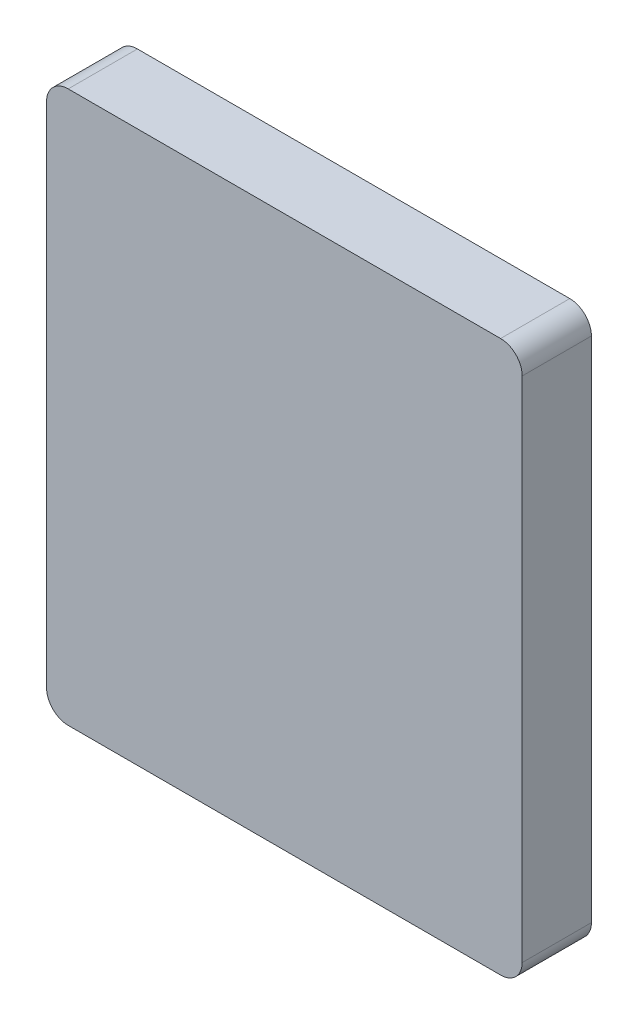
ISO-10303-21;
HEADER;
FILE_DESCRIPTION(('STEP AP214'),'2;1');
FILE_NAME('part.step','',(''),(''),'','','');
FILE_SCHEMA(('AUTOMOTIVE_DESIGN { 1 0 10303 214 1 1 1 1 }'));
ENDSEC;
DATA;
#1=APPLICATION_CONTEXT('core data for automotive mechanical design processes');
#2=APPLICATION_PROTOCOL_DEFINITION('international standard','automotive_design',2000,#1);
#3=PRODUCT_CONTEXT('',#1,'mechanical');
#4=PRODUCT('Part','Part','',(#3));
#5=PRODUCT_RELATED_PRODUCT_CATEGORY('part','',(#4));
#6=PRODUCT_DEFINITION_FORMATION('','',#4);
#7=PRODUCT_DEFINITION_CONTEXT('part definition',#1,'design');
#8=PRODUCT_DEFINITION('design','',#6,#7);
#9=PRODUCT_DEFINITION_SHAPE('','',#8);
#10=(LENGTH_UNIT() NAMED_UNIT(*) SI_UNIT(.MILLI.,.METRE.));
#11=(NAMED_UNIT(*) PLANE_ANGLE_UNIT() SI_UNIT($,.RADIAN.));
#12=(NAMED_UNIT(*) SI_UNIT($,.STERADIAN.) SOLID_ANGLE_UNIT());
#13=UNCERTAINTY_MEASURE_WITH_UNIT(LENGTH_MEASURE(1.E-05),#10,'distance_accuracy_value','');
#14=(GEOMETRIC_REPRESENTATION_CONTEXT(3) GLOBAL_UNCERTAINTY_ASSIGNED_CONTEXT((#13)) GLOBAL_UNIT_ASSIGNED_CONTEXT((#10,
#11,#12)) REPRESENTATION_CONTEXT('',''));
#15=CARTESIAN_POINT('',(0.,0.,0.));
#16=DIRECTION('',(0.,0.,1.));
#17=DIRECTION('',(1.,0.,0.));
#18=AXIS2_PLACEMENT_3D('',#15,#16,#17);
#19=CARTESIAN_POINT('',(0.,0.,8.128));
#20=DIRECTION('',(1.,0.,0.));
#21=DIRECTION('',(0.,0.,-1.));
#22=AXIS2_PLACEMENT_3D('',#19,#20,#21);
#23=PLANE('',#22);
#24=DIRECTION('',(0.,-1.,0.));
#25=VECTOR('',#24,1.);
#26=CARTESIAN_POINT('',(0.,0.,8.128));
#27=LINE('',#26,#25);
#28=CARTESIAN_POINT('',(0.,62.23,8.128));
#29=VERTEX_POINT('',#28);
#30=CARTESIAN_POINT('',(0.,2.54,8.128));
#31=VERTEX_POINT('',#30);
#32=EDGE_CURVE('E126',#29,#31,#27,.T.);
#33=ORIENTED_EDGE('',*,*,#32,.F.);
#34=DIRECTION('',(0.,0.,-1.));
#35=VECTOR('',#34,1.);
#36=CARTESIAN_POINT('',(0.,62.23,8.128));
#37=LINE('',#36,#35);
#38=CARTESIAN_POINT('',(0.,62.23,0.));
#39=VERTEX_POINT('',#38);
#40=EDGE_CURVE('E110',#29,#39,#37,.T.);
#41=ORIENTED_EDGE('',*,*,#40,.T.);
#42=DIRECTION('',(0.,-1.,0.));
#43=VECTOR('',#42,1.);
#44=CARTESIAN_POINT('',(0.,0.,0.));
#45=LINE('',#44,#43);
#46=CARTESIAN_POINT('',(0.,2.54,0.));
#47=VERTEX_POINT('',#46);
#48=EDGE_CURVE('E123',#39,#47,#45,.T.);
#49=ORIENTED_EDGE('',*,*,#48,.T.);
#50=DIRECTION('',(0.,0.,-1.));
#51=VECTOR('',#50,1.);
#52=CARTESIAN_POINT('',(0.,2.54,8.128));
#53=LINE('',#52,#51);
#54=EDGE_CURVE('E129',#47,#31,#53,.F.);
#55=ORIENTED_EDGE('',*,*,#54,.T.);
#56=EDGE_LOOP('',(#33,#41,#49,#55));
#57=FACE_BOUND('',#56,.T.);
#58=ADVANCED_FACE('F39',(#57),#23,.F.);
#59=CARTESIAN_POINT('',(0.,0.,8.128));
#60=DIRECTION('',(0.,1.,0.));
#61=DIRECTION('',(0.,0.,1.));
#62=AXIS2_PLACEMENT_3D('',#59,#60,#61);
#63=PLANE('',#62);
#64=DIRECTION('',(1.,0.,0.));
#65=VECTOR('',#64,1.);
#66=CARTESIAN_POINT('',(0.,0.,8.128));
#67=LINE('',#66,#65);
#68=CARTESIAN_POINT('',(2.54,0.,8.128));
#69=VERTEX_POINT('',#68);
#70=CARTESIAN_POINT('',(53.34,0.,8.128));
#71=VERTEX_POINT('',#70);
#72=EDGE_CURVE('E186',#69,#71,#67,.T.);
#73=ORIENTED_EDGE('',*,*,#72,.F.);
#74=DIRECTION('',(0.,0.,-1.));
#75=VECTOR('',#74,1.);
#76=CARTESIAN_POINT('',(2.54,0.,8.128));
#77=LINE('',#76,#75);
#78=CARTESIAN_POINT('',(2.54,0.,0.));
#79=VERTEX_POINT('',#78);
#80=EDGE_CURVE('E177',#69,#79,#77,.T.);
#81=ORIENTED_EDGE('',*,*,#80,.T.);
#82=DIRECTION('',(1.,0.,0.));
#83=VECTOR('',#82,1.);
#84=CARTESIAN_POINT('',(0.,0.,0.));
#85=LINE('',#84,#83);
#86=CARTESIAN_POINT('',(53.34,0.,0.));
#87=VERTEX_POINT('',#86);
#88=EDGE_CURVE('E134',#79,#87,#85,.T.);
#89=ORIENTED_EDGE('',*,*,#88,.T.);
#90=DIRECTION('',(0.,0.,-1.));
#91=VECTOR('',#90,1.);
#92=CARTESIAN_POINT('',(53.34,0.,8.128));
#93=LINE('',#92,#91);
#94=EDGE_CURVE('E174',#87,#71,#93,.F.);
#95=ORIENTED_EDGE('',*,*,#94,.T.);
#96=EDGE_LOOP('',(#73,#81,#89,#95));
#97=FACE_BOUND('',#96,.T.);
#98=ADVANCED_FACE('F197',(#97),#63,.F.);
#99=CARTESIAN_POINT('',(55.88,0.,8.128));
#100=DIRECTION('',(-1.,0.,0.));
#101=DIRECTION('',(0.,0.,1.));
#102=AXIS2_PLACEMENT_3D('',#99,#100,#101);
#103=PLANE('',#102);
#104=DIRECTION('',(0.,1.,0.));
#105=VECTOR('',#104,1.);
#106=CARTESIAN_POINT('',(55.88,0.,8.128));
#107=LINE('',#106,#105);
#108=CARTESIAN_POINT('',(55.88,2.54,8.128));
#109=VERTEX_POINT('',#108);
#110=CARTESIAN_POINT('',(55.88,62.23,8.128));
#111=VERTEX_POINT('',#110);
#112=EDGE_CURVE('E184',#109,#111,#107,.T.);
#113=ORIENTED_EDGE('',*,*,#112,.F.);
#114=DIRECTION('',(0.,0.,-1.));
#115=VECTOR('',#114,1.);
#116=CARTESIAN_POINT('',(55.88,2.54,8.128));
#117=LINE('',#116,#115);
#118=CARTESIAN_POINT('',(55.88,2.54,0.));
#119=VERTEX_POINT('',#118);
#120=EDGE_CURVE('E11',#109,#119,#117,.T.);
#121=ORIENTED_EDGE('',*,*,#120,.T.);
#122=DIRECTION('',(0.,1.,0.));
#123=VECTOR('',#122,1.);
#124=CARTESIAN_POINT('',(55.88,0.,0.));
#125=LINE('',#124,#123);
#126=CARTESIAN_POINT('',(55.88,62.23,0.));
#127=VERTEX_POINT('',#126);
#128=EDGE_CURVE('E138',#119,#127,#125,.T.);
#129=ORIENTED_EDGE('',*,*,#128,.T.);
#130=DIRECTION('',(0.,0.,-1.));
#131=VECTOR('',#130,1.);
#132=CARTESIAN_POINT('',(55.88,62.23,8.128));
#133=LINE('',#132,#131);
#134=EDGE_CURVE('E48',#127,#111,#133,.F.);
#135=ORIENTED_EDGE('',*,*,#134,.T.);
#136=EDGE_LOOP('',(#113,#121,#129,#135));
#137=FACE_BOUND('',#136,.T.);
#138=ADVANCED_FACE('F203',(#137),#103,.F.);
#139=CARTESIAN_POINT('',(0.,64.77,8.128));
#140=DIRECTION('',(0.,-1.,0.));
#141=DIRECTION('',(0.,0.,-1.));
#142=AXIS2_PLACEMENT_3D('',#139,#140,#141);
#143=PLANE('',#142);
#144=DIRECTION('',(-1.,0.,0.));
#145=VECTOR('',#144,1.);
#146=CARTESIAN_POINT('',(0.,64.77,0.));
#147=LINE('',#146,#145);
#148=CARTESIAN_POINT('',(53.34,64.77,0.));
#149=VERTEX_POINT('',#148);
#150=CARTESIAN_POINT('',(2.54,64.77,0.));
#151=VERTEX_POINT('',#150);
#152=EDGE_CURVE('E146',#149,#151,#147,.T.);
#153=ORIENTED_EDGE('',*,*,#152,.T.);
#154=DIRECTION('',(0.,0.,-1.));
#155=VECTOR('',#154,1.);
#156=CARTESIAN_POINT('',(2.54,64.77,8.128));
#157=LINE('',#156,#155);
#158=CARTESIAN_POINT('',(2.54,64.77,8.128));
#159=VERTEX_POINT('',#158);
#160=EDGE_CURVE('E111',#151,#159,#157,.F.);
#161=ORIENTED_EDGE('',*,*,#160,.T.);
#162=DIRECTION('',(-1.,0.,0.));
#163=VECTOR('',#162,1.);
#164=CARTESIAN_POINT('',(0.,64.77,8.128));
#165=LINE('',#164,#163);
#166=CARTESIAN_POINT('',(53.34,64.77,8.128));
#167=VERTEX_POINT('',#166);
#168=EDGE_CURVE('E141',#167,#159,#165,.T.);
#169=ORIENTED_EDGE('',*,*,#168,.F.);
#170=DIRECTION('',(0.,0.,-1.));
#171=VECTOR('',#170,1.);
#172=CARTESIAN_POINT('',(53.34,64.77,8.128));
#173=LINE('',#172,#171);
#174=EDGE_CURVE('E117',#167,#149,#173,.T.);
#175=ORIENTED_EDGE('',*,*,#174,.T.);
#176=EDGE_LOOP('',(#153,#161,#169,#175));
#177=FACE_BOUND('',#176,.T.);
#178=ADVANCED_FACE('F209',(#177),#143,.F.);
#179=CARTESIAN_POINT('',(0.,0.,8.128));
#180=DIRECTION('',(0.,0.,-1.));
#181=DIRECTION('',(-1.,0.,0.));
#182=AXIS2_PLACEMENT_3D('',#179,#180,#181);
#183=PLANE('',#182);
#184=ORIENTED_EDGE('',*,*,#168,.T.);
#185=CARTESIAN_POINT('',(2.54,62.23,8.128));
#186=DIRECTION('',(0.,0.,-1.));
#187=DIRECTION('',(-1.,0.,0.));
#188=AXIS2_PLACEMENT_3D('',#185,#186,#187);
#189=CIRCLE('',#188,2.54);
#190=EDGE_CURVE('E171',#159,#29,#189,.F.);
#191=ORIENTED_EDGE('',*,*,#190,.T.);
#192=ORIENTED_EDGE('',*,*,#32,.T.);
#193=CARTESIAN_POINT('',(2.54,2.54,8.128));
#194=DIRECTION('',(0.,0.,-1.));
#195=DIRECTION('',(-1.,0.,0.));
#196=AXIS2_PLACEMENT_3D('',#193,#194,#195);
#197=CIRCLE('',#196,2.54);
#198=EDGE_CURVE('E168',#31,#69,#197,.F.);
#199=ORIENTED_EDGE('',*,*,#198,.T.);
#200=ORIENTED_EDGE('',*,*,#72,.T.);
#201=CARTESIAN_POINT('',(53.34,2.54,8.128));
#202=DIRECTION('',(0.,0.,-1.));
#203=DIRECTION('',(-1.,0.,0.));
#204=AXIS2_PLACEMENT_3D('',#201,#202,#203);
#205=CIRCLE('',#204,2.54);
#206=EDGE_CURVE('E61',#71,#109,#205,.F.);
#207=ORIENTED_EDGE('',*,*,#206,.T.);
#208=ORIENTED_EDGE('',*,*,#112,.T.);
#209=CARTESIAN_POINT('',(53.34,62.23,8.128));
#210=DIRECTION('',(0.,0.,-1.));
#211=DIRECTION('',(-1.,0.,0.));
#212=AXIS2_PLACEMENT_3D('',#209,#210,#211);
#213=CIRCLE('',#212,2.54);
#214=EDGE_CURVE('E163',#111,#167,#213,.F.);
#215=ORIENTED_EDGE('',*,*,#214,.T.);
#216=EDGE_LOOP('',(#184,#191,#192,#199,#200,#207,#208,#215));
#217=FACE_BOUND('',#216,.T.);
#218=ADVANCED_FACE('F191',(#217),#183,.F.);
#219=CARTESIAN_POINT('',(0.,0.,0.));
#220=DIRECTION('',(0.,0.,-1.));
#221=DIRECTION('',(-1.,0.,0.));
#222=AXIS2_PLACEMENT_3D('',#219,#220,#221);
#223=PLANE('',#222);
#224=ORIENTED_EDGE('',*,*,#48,.F.);
#225=CARTESIAN_POINT('',(2.54,62.23,0.));
#226=DIRECTION('',(0.,0.,-1.));
#227=DIRECTION('',(-1.,0.,0.));
#228=AXIS2_PLACEMENT_3D('',#225,#226,#227);
#229=CIRCLE('',#228,2.54);
#230=EDGE_CURVE('E106',#39,#151,#229,.T.);
#231=ORIENTED_EDGE('',*,*,#230,.T.);
#232=ORIENTED_EDGE('',*,*,#152,.F.);
#233=CARTESIAN_POINT('',(53.34,62.23,0.));
#234=DIRECTION('',(0.,0.,-1.));
#235=DIRECTION('',(-1.,0.,0.));
#236=AXIS2_PLACEMENT_3D('',#233,#234,#235);
#237=CIRCLE('',#236,2.54);
#238=EDGE_CURVE('E128',#149,#127,#237,.T.);
#239=ORIENTED_EDGE('',*,*,#238,.T.);
#240=ORIENTED_EDGE('',*,*,#128,.F.);
#241=CARTESIAN_POINT('',(53.34,2.54,0.));
#242=DIRECTION('',(0.,0.,-1.));
#243=DIRECTION('',(-1.,0.,0.));
#244=AXIS2_PLACEMENT_3D('',#241,#242,#243);
#245=CIRCLE('',#244,2.54);
#246=EDGE_CURVE('E153',#119,#87,#245,.T.);
#247=ORIENTED_EDGE('',*,*,#246,.T.);
#248=ORIENTED_EDGE('',*,*,#88,.F.);
#249=CARTESIAN_POINT('',(2.54,2.54,0.));
#250=DIRECTION('',(0.,0.,-1.));
#251=DIRECTION('',(-1.,0.,0.));
#252=AXIS2_PLACEMENT_3D('',#249,#250,#251);
#253=CIRCLE('',#252,2.54);
#254=EDGE_CURVE('E118',#79,#47,#253,.T.);
#255=ORIENTED_EDGE('',*,*,#254,.T.);
#256=EDGE_LOOP('',(#224,#231,#232,#239,#240,#247,#248,#255));
#257=FACE_BOUND('',#256,.T.);
#258=ADVANCED_FACE('F131',(#257),#223,.T.);
#259=CARTESIAN_POINT('',(2.54,62.23,8.128));
#260=DIRECTION('',(0.,0.,-1.));
#261=DIRECTION('',(-1.,0.,0.));
#262=AXIS2_PLACEMENT_3D('',#259,#260,#261);
#263=CYLINDRICAL_SURFACE('',#262,2.54);
#264=ORIENTED_EDGE('',*,*,#190,.F.);
#265=ORIENTED_EDGE('',*,*,#160,.F.);
#266=ORIENTED_EDGE('',*,*,#230,.F.);
#267=ORIENTED_EDGE('',*,*,#40,.F.);
#268=EDGE_LOOP('',(#264,#265,#266,#267));
#269=FACE_BOUND('',#268,.T.);
#270=ADVANCED_FACE('F109',(#269),#263,.T.);
#271=CARTESIAN_POINT('',(2.54,2.54,8.128));
#272=DIRECTION('',(0.,0.,-1.));
#273=DIRECTION('',(-1.,0.,0.));
#274=AXIS2_PLACEMENT_3D('',#271,#272,#273);
#275=CYLINDRICAL_SURFACE('',#274,2.54);
#276=ORIENTED_EDGE('',*,*,#198,.F.);
#277=ORIENTED_EDGE('',*,*,#54,.F.);
#278=ORIENTED_EDGE('',*,*,#254,.F.);
#279=ORIENTED_EDGE('',*,*,#80,.F.);
#280=EDGE_LOOP('',(#276,#277,#278,#279));
#281=FACE_BOUND('',#280,.T.);
#282=ADVANCED_FACE('F195',(#281),#275,.T.);
#283=CARTESIAN_POINT('',(53.34,2.54,8.128));
#284=DIRECTION('',(0.,0.,-1.));
#285=DIRECTION('',(-1.,0.,0.));
#286=AXIS2_PLACEMENT_3D('',#283,#284,#285);
#287=CYLINDRICAL_SURFACE('',#286,2.54);
#288=ORIENTED_EDGE('',*,*,#206,.F.);
#289=ORIENTED_EDGE('',*,*,#94,.F.);
#290=ORIENTED_EDGE('',*,*,#246,.F.);
#291=ORIENTED_EDGE('',*,*,#120,.F.);
#292=EDGE_LOOP('',(#288,#289,#290,#291));
#293=FACE_BOUND('',#292,.T.);
#294=ADVANCED_FACE('F202',(#293),#287,.T.);
#295=CARTESIAN_POINT('',(53.34,62.23,8.128));
#296=DIRECTION('',(0.,0.,-1.));
#297=DIRECTION('',(-1.,0.,0.));
#298=AXIS2_PLACEMENT_3D('',#295,#296,#297);
#299=CYLINDRICAL_SURFACE('',#298,2.54);
#300=ORIENTED_EDGE('',*,*,#214,.F.);
#301=ORIENTED_EDGE('',*,*,#134,.F.);
#302=ORIENTED_EDGE('',*,*,#238,.F.);
#303=ORIENTED_EDGE('',*,*,#174,.F.);
#304=EDGE_LOOP('',(#300,#301,#302,#303));
#305=FACE_BOUND('',#304,.T.);
#306=ADVANCED_FACE('F41',(#305),#299,.T.);
#307=CLOSED_SHELL('',(#58,#98,#138,#178,#218,#258,#270,#282,#294,#306));
#308=MANIFOLD_SOLID_BREP('B2',#307);
#309=ADVANCED_BREP_SHAPE_REPRESENTATION('',(#18,#308),#14);
#310=SHAPE_DEFINITION_REPRESENTATION(#9,#309);
ENDSEC;
END-ISO-10303-21;
